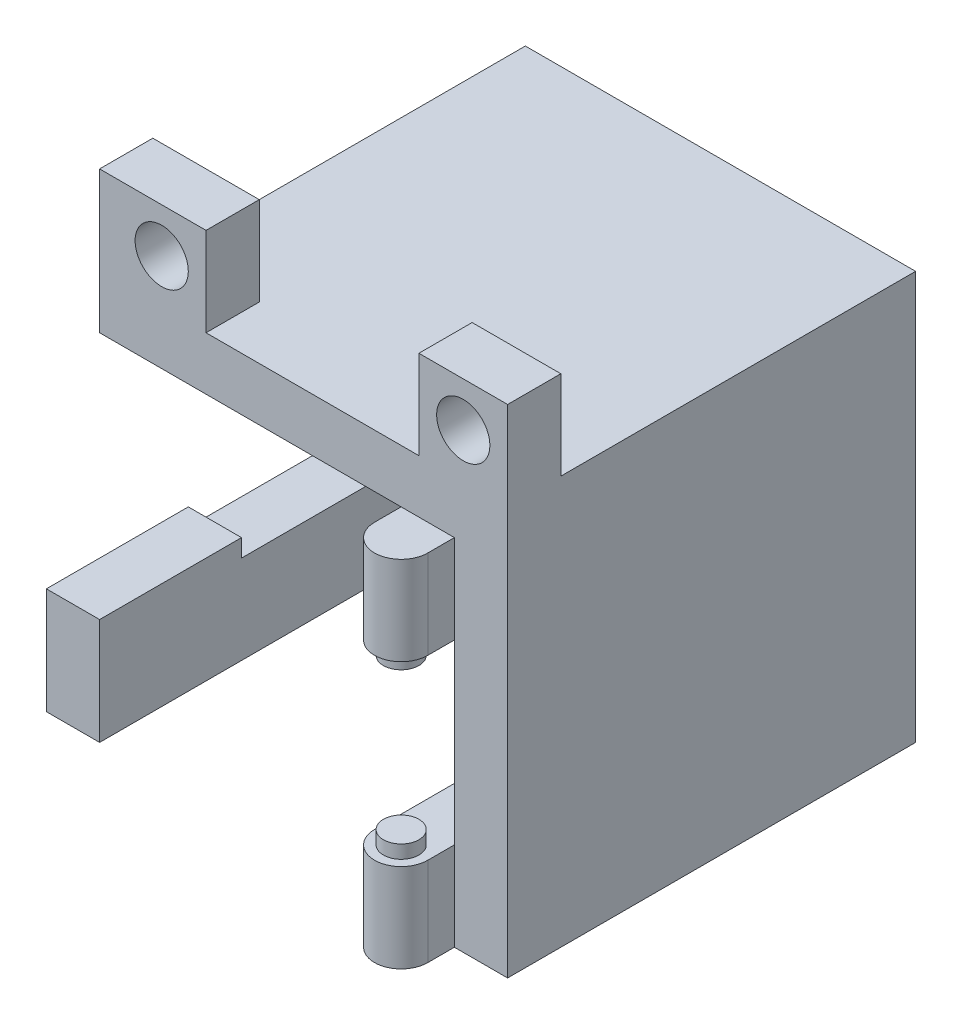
from build123d import *

# Parameters (mm, degrees)
CROQUIS1_W              = 26
CROQUIS1_H              = 23
SALIENTE_EXTRUIR1_DEPTH = 23
CROQUIS2_W              = 20
CROQUIS2_H              = 20
CORTAR_EXTRUIR1_DEPTH   = 20
CORTAR_EXTRUIR3_REACH   = 37.029
CROQUIS6_W              = 5
CROQUIS6_H              = 5
SALIENTE_EXTRUIR2_DEPTH = 3
CROQUIS7_R              = 1.5
CORTAR_EXTRUIR4_DEPTH   = 3
CROQUIS8_W              = 3
CROQUIS8_H              = 8
SALIENTE_EXTRUIR3_DEPTH = 1
SALIENTE_EXTRUIR4_DEPTH = 1
SALIENTE_EXTRUIR5_DEPTH = 5
CROQUIS12_R             = 1
SALIENTE_EXTRUIR7_DEPTH = 0.75


with BuildPart() as part:
    # Croquis1 → Saliente-Extruir1 (new body)
    with BuildSketch(Plane(origin=(0, 0, 0), x_dir=(1, 0, 0), z_dir=(0, 1, 0))):
        Rectangle(CROQUIS1_W, CROQUIS1_H)
    extrude(amount=SALIENTE_EXTRUIR1_DEPTH)

    # Croquis2 → Cortar-Extruir1 (cut)
    with BuildSketch(Plane.XY.offset(11.5)):
        with Locations((0, 10)):
            Rectangle(CROQUIS2_W, CROQUIS2_H)
    extrude(amount=-CORTAR_EXTRUIR1_DEPTH, mode=Mode.SUBTRACT)

    # Croquis5 → Cortar-Extruir3 (cut, up to next)
    with BuildSketch(Plane.XY.offset(11.5), mode=Mode.PRIVATE) as cortar_extruir3_sk1:
        Polygon((-13, 23), (-9, 23), (-9, 20), (-8, 20), (-8, 11), (-9, 11), (-9, 5), (-13, 5), align=None)
    cortar_extruir3_tool1 = extrude(cortar_extruir3_sk1.sketch, amount=-CORTAR_EXTRUIR3_REACH, mode=Mode.PRIVATE) & part.part
    add(cortar_extruir3_tool1.solids().sort_by_distance((-10.722222, 14.166667, 11.5))[0], mode=Mode.SUBTRACT)

    # Croquis6 → Saliente-Extruir2 (add)
    with BuildSketch(Plane.XY.offset(11.5)):
        with Locations((-6.5, 25.5)):
            Rectangle(CROQUIS6_W, CROQUIS6_H)
        with Locations((10.5, 25.5)):
            Rectangle(CROQUIS6_W, CROQUIS6_H)
    extrude(amount=-SALIENTE_EXTRUIR2_DEPTH)

    # Croquis7 → Cortar-Extruir4 (cut)
    with BuildSketch(Plane.XY.offset(11.5)):
        with Locations((-6.5, 25.5)):
            Circle(CROQUIS7_R)
        with Locations((10.5, 25.5)):
            Circle(CROQUIS7_R)
    extrude(amount=-CORTAR_EXTRUIR4_DEPTH, mode=Mode.SUBTRACT)

    # Croquis8 → Saliente-Extruir3 (add)
    with BuildSketch(Plane(origin=(0, 5, 0), x_dir=(1, 0, 0), z_dir=(0, 1, 0))):
        with Locations((-11.5, -7.5)):
            Rectangle(CROQUIS8_W, CROQUIS8_H)
    extrude(amount=SALIENTE_EXTRUIR3_DEPTH)

    # Croquis9 → Saliente-Extruir4 (add)
    with BuildSketch(Plane.ZY.offset(9)):
        Polygon((8.5, 23), (8.5, 28), (11.5, 28), (11.5, 20), (3.5, 20), (3.5, 23), align=None)
    extrude(amount=SALIENTE_EXTRUIR4_DEPTH)

    # Croquis10 → Saliente-Extruir5 (add)
    with BuildSketch(Plane.XZ):
        with BuildLine():
            Line((7, 8.5), (7, 11.5))
            Line((7, 11.5), (7, 13))
            ThreePointArc((7, 13), (8.5, 14.5), (10, 13))
            Line((10, 13), (10, 11.5))
            Line((10, 11.5), (10, 8.5))
            Line((10, 8.5), (7, 8.5))
        make_face()
    saliente_extruir5 = extrude(amount=-SALIENTE_EXTRUIR5_DEPTH)

    # Croquis12 → Saliente-Extruir7 (add)
    with BuildSketch(Plane(origin=(0, 5, 0), x_dir=(1, 0, 0), z_dir=(0, 1, 0))):
        with Locations(Location((8.5, -13, 0), (0, 0, 90))):
            Circle(CROQUIS12_R)
    saliente_extruir7 = extrude(amount=SALIENTE_EXTRUIR7_DEPTH)

    # Simetr_a1: Saliente-Extruir5, Saliente-Extruir7 across plane
    add(saliente_extruir5.mirror(Plane(origin=(0, 10, 0), x_dir=(0, 0, 1), z_dir=(0, -1, 0))))
    add(saliente_extruir7.mirror(Plane(origin=(0, 10, 0), x_dir=(0, 0, 1), z_dir=(0, -1, 0))))


solid = part.part
